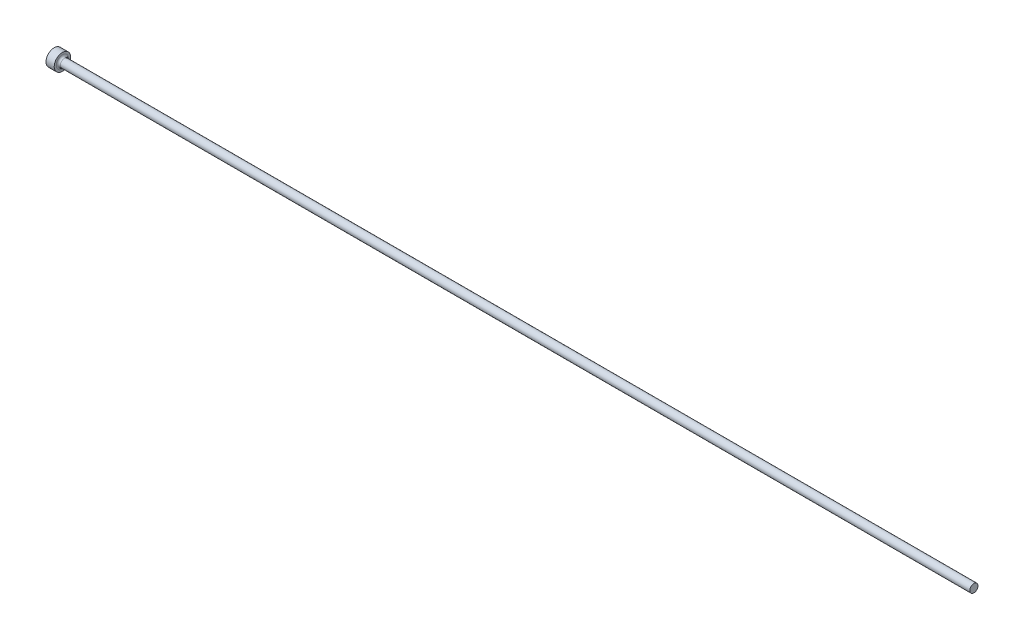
from build123d import *


with BuildPart() as part:
    # Sketch1 → PIN (revolve)
    with BuildSketch(Plane.XY, mode=Mode.PRIVATE) as pin_sk:
        with BuildLine():
            Line((0, 0), (0, 3.175))
            Line((0, 3.175), (3.175, 3.175))
            Line((3.175, 3.175), (3.175, 2.3749))
            ThreePointArc((3.175, 2.3749), (3.40562412, 1.81812412), (3.9624, 1.5875))
            Line((3.9624, 1.5875), (355.6, 1.5875))
            Line((355.6, 1.5875), (355.6, 0))
            Line((355.6, 0), (0, 0))
        make_face()
    revolve(pin_sk.sketch.rotate(Axis((355.6, 0, 0), (-1, 0, 0)), 180), axis=Axis((355.6, 0, 0), (-1, 0, 0)))


solid = part.part
